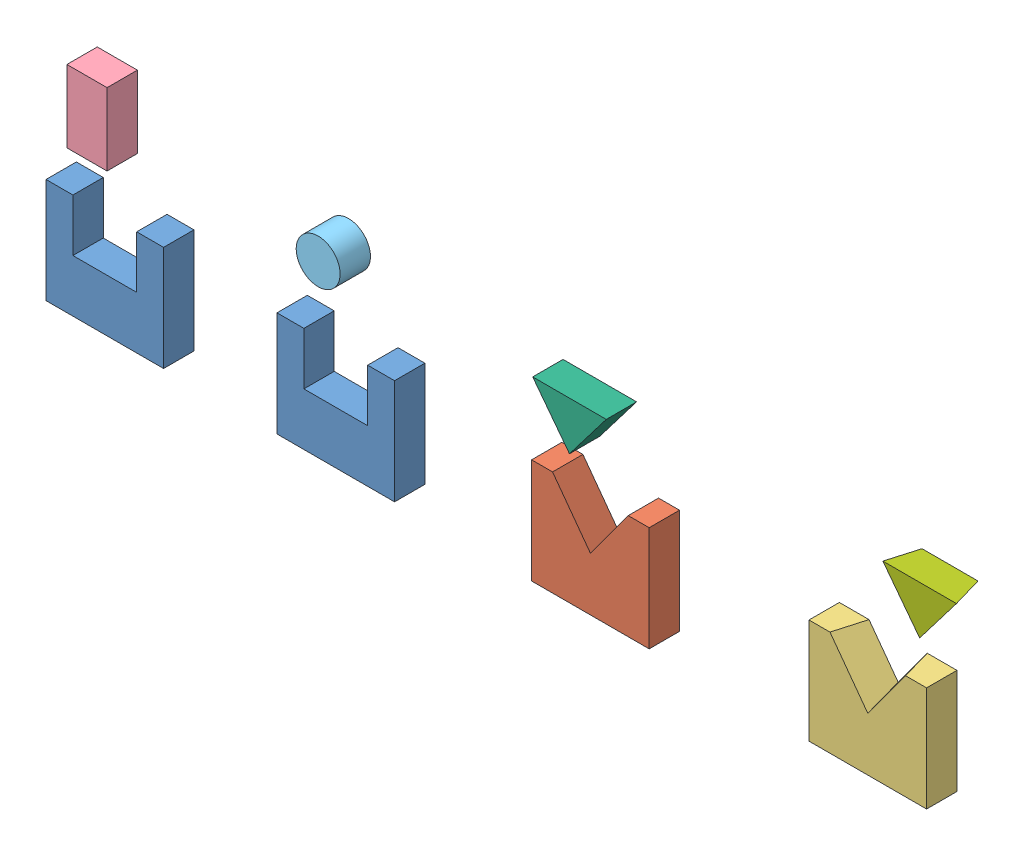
SolidWorks assembly Width Mates.SLDASM, configuration Default (file format 3400). Lengths in mm.
Overall size (762.03 179.95 25.4).
8 component instances, 7 part files, 10 mates.
Components (placement in the parent):
- block-1: block.SLDPRT [Default] at (-49.4048 -43.7766 -12.6981) size (98.42 87.85 25.4)
- block-2: block.SLDPRT [Default] at (143.9038 -43.7766 -12.6981) size (98.42 87.85 25.4)
- block2-3: block2.SLDPRT [Default] at (357.0093 -43.7766 -12.6981) size (98.42 87.85 25.4)
- block3-2: block3.SLDPRT [Default] at (589.1977 -43.7766 -12.6981) size (98.42 87.85 25.4)
- tab1-1: tab1.SLDPRT [Default] at (-31.9082 75.7078 -12.6981) size (33.6 60.46 25.4)
- tab2-1: tab2.SLDPRT [Default] at (178.3733 98.5733 -12.6981) size (36.74 36.74 25.4)
- tab3-1: tab3.SLDPRT [Default] at (388.7289 64.2916 -12.6981) size (61.59 40.35 25.4)
- tab4-1: tab4.SLDPRT [Default] at (681.8255 77.3097 12.7019) size (61.59 40.35 25.4)
Mates (geometry in assembly coordinates):
- Coincident1: coincident aligned: plane of block-1 through (-0.1949 -102.6062 12.7019) normal (0 0 1); plane of block-2 through (193.1137 -102.6062 12.7019) normal (0 0 1)
- Coincident2: coincident aligned: plane of block-1 through (-0.1949 44.0736 12.7019) normal (0 1 0); plane of block-2 through (193.1137 44.0736 12.7019) normal (0 1 0)
- Coincident3: coincident aligned: plane of block-2 through (193.1137 -102.6062 12.7019) normal (0 0 1); plane of block2-3 through (357.0093 44.0736 12.7019) normal (0 0 1)
- Coincident4: coincident aligned: plane of block-2 through (193.1137 44.0736 12.7019) normal (0 1 0); plane of block2-3 through (357.0093 44.0736 12.7019) normal (0 1 0)
- Coincident5: coincident aligned: plane of block2-3 through (357.0093 44.0736 12.7019) normal (0 0 1); plane of block3-2 through (589.1977 44.0736 12.7019) normal (0 0 1)
- Coincident6: coincident aligned: plane of block2-3 through (357.0093 44.0736 12.7019) normal (0 1 0); plane of block3-2 through (589.1977 44.0736 12.7019) normal (0 1 0)
- Coincident7: coincident aligned: plane of block-1 through (-0.1949 -102.6062 12.7019) normal (0 0 1); plane of tab1-1 through (-31.9082 136.17 12.7019) normal (0 0 1)
- Coincident8: coincident aligned: plane of block-2 through (193.1137 -102.6062 12.7019) normal (0 0 1); plane of tab2-1 through (178.3733 98.5733 12.7019) normal (0 0 1)
- Coincident9: coincident aligned: plane of block2-3 through (357.0093 44.0736 12.7019) normal (0 0 1); plane of tab3-1 through (388.7289 64.2916 12.7019) normal (0 0 1)
- Coincident10: coincident aligned: plane of block3-2 through (589.1977 44.0736 12.7019) normal (0 0 1); plane of tab4-1 through (681.8255 77.3097 12.7019) normal (0 0 1)
